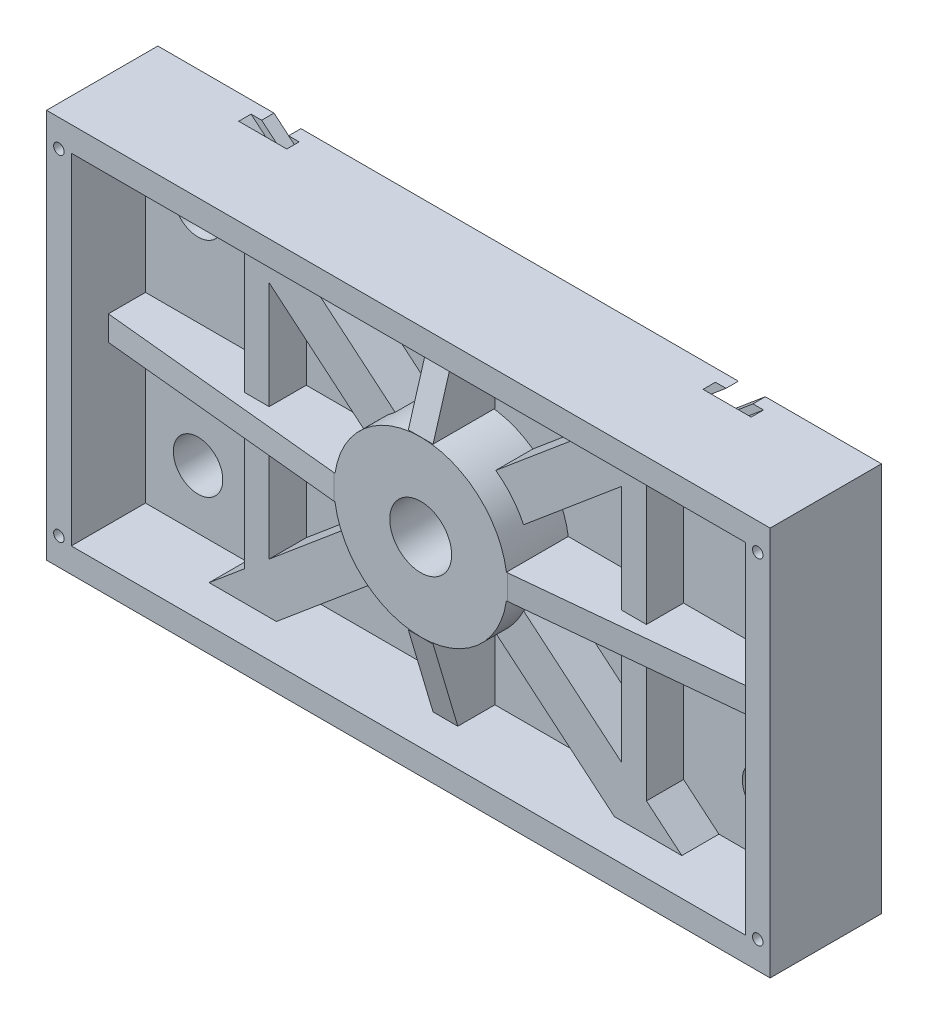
from build123d import *

# Parameters (mm, degrees)
SKETCH_1_W                   = 585
SKETCH_1_H                   = 315
SKETCH_1_R                   = 20
SKETCH_1_R_2                 = 25
EXTRUDE_1_DEPTH              = 90
SKETCH_2_W                   = 545
SKETCH_2_H                   = 275
CUT_EXTRUDE_1_DEPTH          = 60
SKETCH_3_R                   = 70
SKETCH_3_R_2                 = 25
EXTRUDE_2_DEPTH              = 50
EXTRUDE_4_DEPTH              = 10
EXTRUDE_4_DEPTH_BACK         = 10
EXTRUDE_4_2_DEPTH            = 10
EXTRUDE_4_2_DEPTH_BACK       = 10
SKETCH_5_W                   = 50
SKETCH_5_H                   = 20
EXTRUDE_5_DEPTH              = 0.717968
SKETCH_8_W                   = 50
SKETCH_8_H                   = 20
EXTRUDE_6_DEPTH              = 0.717968
EXTRUDE_7_DEPTH              = 10
EXTRUDE_7_DEPTH_BACK         = 10
EXTRUDE_7_2_DEPTH            = 10
EXTRUDE_7_2_DEPTH_BACK       = 10
EXTRUDE_8_DEPTH              = 30
EXTRUDE_9_DEPTH              = 30
CUT_EXTRUDE_2_DEPTH          = 299
CUT_EXTRUDE_2_DEPTH_BACK     = 284
CUT_EXTRUDE_3_DEPTH          = 284
CUT_EXTRUDE_3_DEPTH_BACK     = 284
HOLE_WIZARD_M10_1_AT_2_COUNT = 2
HOLE_WIZARD_M10_1_AT_2_PITCH = 565
HOLE_WIZARD_M10_1_AT_3_COUNT = 2
HOLE_WIZARD_M10_1_AT_3_PITCH = 626.630672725
HOLE_WIZARD_M10_1_AT_4_COUNT = 2
HOLE_WIZARD_M10_1_AT_4_PITCH = 271


with BuildPart() as part:
    # Sketch 1 → Extrude 1 (new body)
    with BuildSketch(Plane.XY):
        Rectangle(SKETCH_1_W, SKETCH_1_H)
        with Locations(Location((-230, -90, 0), (0, 0, 180))):
            Circle(SKETCH_1_R, mode=Mode.SUBTRACT)
        with Locations(Location((0, 0, 0), (0, 0, 180))):
            Circle(SKETCH_1_R_2, mode=Mode.SUBTRACT)
        with Locations(Location((-230, 90, 0), (0, 0, 180))):
            Circle(SKETCH_1_R, mode=Mode.SUBTRACT)
        with Locations(Location((230, -90, 0), (0, 0, 180))):
            Circle(SKETCH_1_R, mode=Mode.SUBTRACT)
        with Locations(Location((230, 90, 0), (0, 0, 180))):
            Circle(SKETCH_1_R, mode=Mode.SUBTRACT)
    extrude(amount=EXTRUDE_1_DEPTH)

    # Sketch 2 → Cut-Extrude 1 (cut)
    with BuildSketch(Plane.XY.offset(90)):
        Rectangle(SKETCH_2_W, SKETCH_2_H)
    extrude(amount=-CUT_EXTRUDE_1_DEPTH, mode=Mode.SUBTRACT)

    # Sketch 3 → Extrude 2 (add)
    with BuildSketch(Plane.XY.offset(30)):
        with Locations(Location((0, 0, 0), (0, 0, 180))):
            Circle(SKETCH_3_R)
        with Locations(Location((0, 0, 0), (0, 0, 180))):
            Circle(SKETCH_3_R_2, mode=Mode.SUBTRACT)
    extrude(amount=EXTRUDE_2_DEPTH)



with BuildPart() as body_2:
    # Sketch 4 → Extrude 4 (new, two sides: drawn at the far end of the back side and taken through both)
    with BuildSketch(Plane(origin=(0, 0, 0), x_dir=(1, 0, 0), z_dir=(0, 1, 0)).offset(-EXTRUDE_4_DEPTH_BACK)):
        Polygon((-272.5, -30), (-272.5, -60), (-70, -80), (-70, -30), align=None)
    extrude(amount=EXTRUDE_4_DEPTH + EXTRUDE_4_DEPTH_BACK)


with BuildPart() as body_3:
    # Sketch 4 → Extrude 4 2 (new, two sides: drawn at the far end of the back side and taken through both)
    with BuildSketch(Plane(origin=(0, 0, 0), x_dir=(1, 0, 0), z_dir=(0, 1, 0)).offset(-EXTRUDE_4_2_DEPTH_BACK)):
        Polygon((70, -80), (70, -30), (272.5, -30), (272.5, -60), align=None)
    extrude(amount=EXTRUDE_4_2_DEPTH + EXTRUDE_4_2_DEPTH_BACK)


with BuildPart() as part_1:
    add(part.part)

    add(body_2.part)  # Extrude 5 merges body 2
    # Sketch 5 → Extrude 5 (add)
    with BuildSketch(Plane(origin=(-70, 0, 0), x_dir=(0, 0, -1), z_dir=(1, 0, 0))):
        with Locations((-55, 0)):
            Rectangle(SKETCH_5_W, SKETCH_5_H)
    extrude(amount=EXTRUDE_5_DEPTH)


    add(body_3.part)  # Extrude 6 merges body 3
    # Sketch 8 → Extrude 6 (add)
    with BuildSketch(Plane.ZY.offset(-70)):
        with Locations((55, 0)):
            Rectangle(SKETCH_8_W, SKETCH_8_H)
    extrude(amount=EXTRUDE_6_DEPTH)

    # Sketch 10 → Extrude 8 (add)
    with BuildSketch(Plane.XY.offset(30)):
        with BuildLine():
            Line((-136.640952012, 137.5), (-40.671570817, 56.972127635))
            ThreePointArc((-40.671570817, 56.972127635), (-53.623111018, 44.995132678), (-63.169137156, 30.160572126))
            Line((-63.169137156, 30.160572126), (-191.091285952, 137.5))
            Line((-191.091285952, 137.5), (-136.640952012, 137.5))
        make_face()
        with BuildLine():
            Line((191.091285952, 137.5), (63.169137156, 30.160572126))
            ThreePointArc((63.169137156, 30.160572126), (53.623111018, 44.995132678), (40.671570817, 56.972127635))
            Line((40.671570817, 56.972127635), (136.640952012, 137.5))
            Line((136.640952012, 137.5), (191.091285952, 137.5))
        make_face()
        with BuildLine():
            Line((136.640952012, -137.5), (191.091285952, -137.5))
            Line((191.091285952, -137.5), (63.169137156, -30.160572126))
            ThreePointArc((63.169137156, -30.160572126), (53.623111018, -44.995132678), (40.671570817, -56.972127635))
            Line((40.671570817, -56.972127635), (136.640952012, -137.5))
        make_face()
        with BuildLine():
            Line((-191.091285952, -137.5), (-136.640952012, -137.5))
            Line((-136.640952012, -137.5), (-40.671570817, -56.972127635))
            ThreePointArc((-40.671570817, -56.972127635), (-53.623111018, -44.995132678), (-63.169137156, -30.160572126))
            Line((-63.169137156, -30.160572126), (-191.091285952, -137.5))
        make_face()
    extrude(amount=EXTRUDE_8_DEPTH)

    # Sketch 11 → Extrude 9 (add)
    with BuildSketch(Plane.XY.offset(30)):
        Polygon((142.5, -96.727069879), (142.5, -10), (162.5, -10), (162.5, -113.509062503), align=None)
        Polygon((-142.5, 96.727069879), (-162.5, 113.509062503), (-162.5, 10), (-142.5, 10), align=None)
        Polygon((142.5, 96.727069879), (162.5, 113.509062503), (162.5, 10), (142.5, 10), align=None)
        Polygon((-142.5, -10), (-162.5, -10), (-162.5, -113.509062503), (-142.5, -96.727069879), align=None)
    extrude(amount=EXTRUDE_9_DEPTH)

    # Sketch 14 → Cut-Extrude 2 (cut, two sides: drawn at the far end of the back side and taken through both)
    with BuildSketch(Plane(origin=(0, 0, 0), x_dir=(0, 0, -1), z_dir=(0.7660444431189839, -0.6427876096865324, 0)).offset(-CUT_EXTRUDE_2_DEPTH_BACK)):
        Polygon((0, 7), (0, -7), (-10, -7), (-10, -12.5), (-20, -12.5), (-20, 12.5), (-10, 12.5), (-10, 7), align=None)
    extrude(amount=CUT_EXTRUDE_2_DEPTH + CUT_EXTRUDE_2_DEPTH_BACK, mode=Mode.SUBTRACT)

    # Sketch 15 → Cut-Extrude 3 (cut, two sides: drawn at the far end of the back side and taken through both)
    with BuildSketch(Plane(origin=(0, 0, 0), x_dir=(0, 0, 1), z_dir=(-0.7660444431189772, -0.6427876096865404, 0)).offset(-CUT_EXTRUDE_3_DEPTH_BACK)):
        Polygon((0, 7), (0, -7), (10, -7), (10, -12.5), (20, -12.5), (20, 12.5), (10, 12.5), (10, 7), align=None)
    extrude(amount=CUT_EXTRUDE_3_DEPTH + CUT_EXTRUDE_3_DEPTH_BACK, mode=Mode.SUBTRACT)

    # Sketch 17 → Hole Wizard M10 _1 (revolve, cut)
    with BuildSketch(Plane(origin=(282.5, -135.5, 90), x_dir=(0, -1, 0), z_dir=(1, 0, 0))):
        Polygon((0, 0), (0, 27.053657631), (4.25, 24.5), (4.25, 0), align=None)
    hole_wizard_m10_1 = revolve(axis=Axis((282.5, -135.5, 96.35), (0, 0, -1)), mode=Mode.SUBTRACT)

    # Hole Wizard M10 _1 at 2: Hole Wizard M10 _1 ×2
    with Locations(*[(-i * HOLE_WIZARD_M10_1_AT_2_PITCH, 0, 0) for i in range(1, HOLE_WIZARD_M10_1_AT_2_COUNT)]):
        add(hole_wizard_m10_1, mode=Mode.SUBTRACT)

    # Hole Wizard M10 _1 at 3: Hole Wizard M10 _1 ×2
    with Locations(*[Vector(-0.9016475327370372, 0.43247164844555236, 0) * (i * HOLE_WIZARD_M10_1_AT_3_PITCH) for i in range(1, HOLE_WIZARD_M10_1_AT_3_COUNT)]):
        add(hole_wizard_m10_1, mode=Mode.SUBTRACT)

    # Hole Wizard M10 _1 at 4: Hole Wizard M10 _1 ×2
    with Locations(*[(0, i * HOLE_WIZARD_M10_1_AT_4_PITCH, 0) for i in range(1, HOLE_WIZARD_M10_1_AT_4_COUNT)]):
        add(hole_wizard_m10_1, mode=Mode.SUBTRACT)


with BuildPart() as body_2_2:
    # Sketch 9 → Extrude 7 (new, two sides: drawn at the far end of the back side and taken through both)
    with BuildSketch(Plane(origin=(0, 0, 0), x_dir=(0, 0, -1), z_dir=(1, 0, 0)).offset(-EXTRUDE_7_DEPTH_BACK)):
        Polygon((-30, -137.5), (-60, -137.5), (-80, -70), (-30, -70), align=None)
    extrude(amount=EXTRUDE_7_DEPTH + EXTRUDE_7_DEPTH_BACK)


with BuildPart() as body_3_2:
    # Sketch 9 → Extrude 7 2 (new, two sides: drawn at the far end of the back side and taken through both)
    with BuildSketch(Plane(origin=(0, 0, 0), x_dir=(0, 0, -1), z_dir=(1, 0, 0)).offset(-EXTRUDE_7_2_DEPTH_BACK)):
        Polygon((-30, 137.5), (-60, 137.5), (-80, 70), (-30, 70), align=None)
    extrude(amount=EXTRUDE_7_2_DEPTH + EXTRUDE_7_2_DEPTH_BACK)


solid = Compound([part_1.part, body_2_2.part, body_3_2.part])
